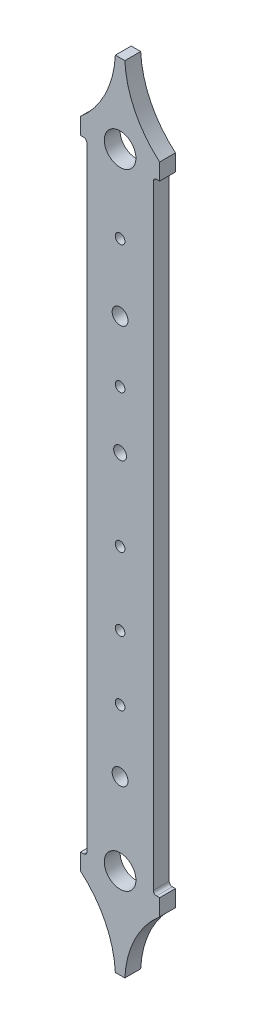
from build123d import *

# Parameters (mm, degrees)
BOSS_EXTRUDE1_DEPTH = 10
FILLET1_R           = 2
SKETCH3_R           = 10
SKETCH3_R_2         = 3.05
SKETCH3_R_3         = 5
SKETCH3_R_4         = 4.05
CUT_EXTRUDE1_DEPTH  = 56


with BuildPart() as part:
    # Sketch1 → Boss-Extrude1 (new body)
    with BuildSketch(Plane.XY):
        with BuildLine():
            Line((25, -196.063687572), (21, -196.063687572))
            Line((21, -196.063687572), (21, 196.063687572))
            Line((21, 196.063687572), (25, 196.063687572))
            Line((25, 196.063687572), (25, 206.533687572))
            ThreePointArc((25, 206.533687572), (9.399015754, 226.490476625), (3, 251))
            Line((3, 251), (-3, 251))
            ThreePointArc((-3, 251), (-9.399015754, 226.490476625), (-25, 206.533687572))
            Line((-25, 206.533687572), (-25, 196.063687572))
            Line((-25, 196.063687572), (-21, 196.063687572))
            Line((-21, 196.063687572), (-21, -196.063687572))
            Line((-21, -196.063687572), (-25, -196.063687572))
            Line((-25, -196.063687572), (-25, -206.533687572))
            ThreePointArc((-25, -206.533687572), (-9.399015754, -226.490476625), (-3, -251))
            Line((-3, -251), (3, -251))
            ThreePointArc((3, -251), (9.399015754, -226.490476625), (25, -206.533687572))
            Line((25, -206.533687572), (25, -196.063687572))
        make_face()
    extrude(amount=BOSS_EXTRUDE1_DEPTH)

    # Fillet1
    fillet1_edges = [part.edges().sort_by_distance(p)[0] for p in [
        (21, -196.063687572, 5),
        (-21, -196.063687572, 5),
        (-21, 196.063687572, 5),
        (21, 196.063687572, 5),
    ]]
    fillet(fillet1_edges, radius=FILLET1_R)

    # Sketch3 → Cut-Extrude1 (cut)
    with BuildSketch(Plane.XY.offset(10)):
        with Locations((0, 201.063687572)):
            Circle(SKETCH3_R)
        with Locations((0, 152.063687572)):
            Circle(SKETCH3_R_2)
        with Locations((0, 109.663687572)):
            Circle(SKETCH3_R_3)
        with Locations((0, 71.063687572)):
            Circle(SKETCH3_R_2)
        with Locations((0, 34.913687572)):
            Circle(SKETCH3_R_4)
        with Locations((0, -16.336312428)):
            Circle(SKETCH3_R_2)
        with Locations((0, -62.336312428)):
            Circle(SKETCH3_R_2)
        with Locations((0, -103.016312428)):
            Circle(SKETCH3_R_2)
        with Locations((0, -142.336312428)):
            Circle(SKETCH3_R_3)
        with Locations((0, -193.936312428)):
            Circle(SKETCH3_R)
    extrude(amount=-CUT_EXTRUDE1_DEPTH, mode=Mode.SUBTRACT)


solid = part.part
